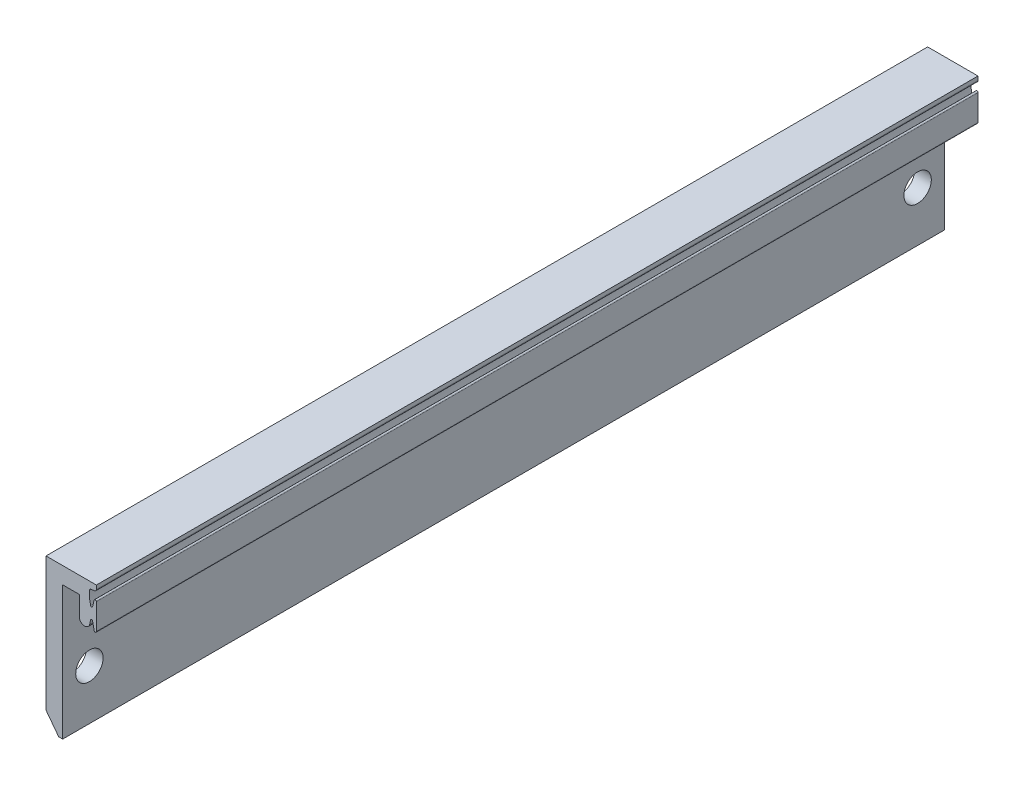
ISO-10303-21;
HEADER;
FILE_DESCRIPTION(('STEP AP214'),'2;1');
FILE_NAME('part.step','',(''),(''),'','','');
FILE_SCHEMA(('AUTOMOTIVE_DESIGN { 1 0 10303 214 1 1 1 1 }'));
ENDSEC;
DATA;
#1=APPLICATION_CONTEXT('core data for automotive mechanical design processes');
#2=APPLICATION_PROTOCOL_DEFINITION('international standard','automotive_design',2000,#1);
#3=PRODUCT_CONTEXT('',#1,'mechanical');
#4=PRODUCT('Part','Part','',(#3));
#5=PRODUCT_RELATED_PRODUCT_CATEGORY('part','',(#4));
#6=PRODUCT_DEFINITION_FORMATION('','',#4);
#7=PRODUCT_DEFINITION_CONTEXT('part definition',#1,'design');
#8=PRODUCT_DEFINITION('design','',#6,#7);
#9=PRODUCT_DEFINITION_SHAPE('','',#8);
#10=(LENGTH_UNIT() NAMED_UNIT(*) SI_UNIT(.MILLI.,.METRE.));
#11=(NAMED_UNIT(*) PLANE_ANGLE_UNIT() SI_UNIT($,.RADIAN.));
#12=(NAMED_UNIT(*) SI_UNIT($,.STERADIAN.) SOLID_ANGLE_UNIT());
#13=UNCERTAINTY_MEASURE_WITH_UNIT(LENGTH_MEASURE(1.E-05),#10,'distance_accuracy_value','');
#14=(GEOMETRIC_REPRESENTATION_CONTEXT(3) GLOBAL_UNCERTAINTY_ASSIGNED_CONTEXT((#13)) GLOBAL_UNIT_ASSIGNED_CONTEXT((#10,
#11,#12)) REPRESENTATION_CONTEXT('',''));
#15=CARTESIAN_POINT('',(0.,0.,0.));
#16=DIRECTION('',(0.,0.,1.));
#17=DIRECTION('',(1.,0.,0.));
#18=AXIS2_PLACEMENT_3D('',#15,#16,#17);
#19=CARTESIAN_POINT('',(2473.35258692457,1.1297441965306E-09,66.));
#20=DIRECTION('',(1.,4.56766335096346E-13,0.));
#21=DIRECTION('',(-4.56766335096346E-13,1.,0.));
#22=AXIS2_PLACEMENT_3D('',#19,#20,#21);
#23=PLANE('',#22);
#24=DIRECTION('',(4.56766335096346E-13,-1.,0.));
#25=VECTOR('',#24,1.);
#26=CARTESIAN_POINT('',(2473.35258692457,1.1297441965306E-09,-66.));
#27=LINE('',#26,#25);
#28=CARTESIAN_POINT('',(2473.35258692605,-3238.37710777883,-66.));
#29=VERTEX_POINT('',#28);
#30=CARTESIAN_POINT('',(2473.35258692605,-3241.29384556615,-66.));
#31=VERTEX_POINT('',#30);
#32=EDGE_CURVE('E213',#29,#31,#27,.T.);
#33=ORIENTED_EDGE('',*,*,#32,.T.);
#34=DIRECTION('',(0.,0.,-1.));
#35=VECTOR('',#34,1.);
#36=CARTESIAN_POINT('',(2473.35258692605,-3241.29384556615,66.));
#37=LINE('',#36,#35);
#38=CARTESIAN_POINT('',(2473.35258692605,-3241.29384556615,66.));
#39=VERTEX_POINT('',#38);
#40=EDGE_CURVE('E11',#39,#31,#37,.T.);
#41=ORIENTED_EDGE('',*,*,#40,.F.);
#42=DIRECTION('',(4.56766335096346E-13,-1.,0.));
#43=VECTOR('',#42,1.);
#44=CARTESIAN_POINT('',(2473.35258692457,1.1297441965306E-09,66.));
#45=LINE('',#44,#43);
#46=CARTESIAN_POINT('',(2473.35258692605,-3238.37710777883,66.));
#47=VERTEX_POINT('',#46);
#48=EDGE_CURVE('E267',#47,#39,#45,.T.);
#49=ORIENTED_EDGE('',*,*,#48,.F.);
#50=DIRECTION('',(0.,0.,-1.));
#51=VECTOR('',#50,1.);
#52=CARTESIAN_POINT('',(2473.35258692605,-3238.37710777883,66.));
#53=LINE('',#52,#51);
#54=EDGE_CURVE('E209',#47,#29,#53,.T.);
#55=ORIENTED_EDGE('',*,*,#54,.T.);
#56=EDGE_LOOP('',(#33,#41,#49,#55));
#57=FACE_BOUND('',#56,.T.);
#58=ADVANCED_FACE('F39',(#57),#23,.F.);
#59=CARTESIAN_POINT('',(2474.13562881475,-3241.29384556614,66.));
#60=DIRECTION('',(0.,0.,-1.));
#61=DIRECTION('',(-1.,0.,0.));
#62=AXIS2_PLACEMENT_3D('',#59,#60,#61);
#63=CYLINDRICAL_SURFACE('',#62,0.783041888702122);
#64=CARTESIAN_POINT('',(2474.13562881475,-3241.29384556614,-66.));
#65=DIRECTION('',(0.,0.,1.));
#66=DIRECTION('',(1.,0.,0.));
#67=AXIS2_PLACEMENT_3D('',#64,#65,#66);
#68=CIRCLE('',#67,0.783041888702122);
#69=CARTESIAN_POINT('',(2474.90170185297,-3241.4559773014,-66.));
#70=VERTEX_POINT('',#69);
#71=EDGE_CURVE('E216',#31,#70,#68,.T.);
#72=ORIENTED_EDGE('',*,*,#71,.T.);
#73=DIRECTION('',(0.,0.,-1.));
#74=VECTOR('',#73,1.);
#75=CARTESIAN_POINT('',(2474.90170185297,-3241.4559773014,66.));
#76=LINE('',#75,#74);
#77=CARTESIAN_POINT('',(2474.90170185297,-3241.4559773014,66.));
#78=VERTEX_POINT('',#77);
#79=EDGE_CURVE('E48',#78,#70,#76,.T.);
#80=ORIENTED_EDGE('',*,*,#79,.F.);
#81=CARTESIAN_POINT('',(2474.13562881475,-3241.29384556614,66.));
#82=DIRECTION('',(0.,0.,1.));
#83=DIRECTION('',(1.,0.,0.));
#84=AXIS2_PLACEMENT_3D('',#81,#82,#83);
#85=CIRCLE('',#84,0.783041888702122);
#86=EDGE_CURVE('E135',#39,#78,#85,.T.);
#87=ORIENTED_EDGE('',*,*,#86,.F.);
#88=ORIENTED_EDGE('',*,*,#40,.T.);
#89=EDGE_LOOP('',(#72,#80,#87,#88));
#90=FACE_BOUND('',#89,.T.);
#91=ADVANCED_FACE('F385',(#90),#63,.T.);
#92=CARTESIAN_POINT('',(3025.41088073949,-640.298106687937,66.));
#93=DIRECTION('',(-0.978329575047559,0.207053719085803,0.));
#94=DIRECTION('',(-0.207053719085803,-0.978329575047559,0.));
#95=AXIS2_PLACEMENT_3D('',#92,#93,#94);
#96=PLANE('',#95);
#97=DIRECTION('',(0.207053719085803,0.978329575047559,0.));
#98=VECTOR('',#97,1.);
#99=CARTESIAN_POINT('',(3025.41088073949,-640.298106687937,-66.));
#100=LINE('',#99,#98);
#101=CARTESIAN_POINT('',(2475.03432887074,-3240.82931416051,-66.));
#102=VERTEX_POINT('',#101);
#103=EDGE_CURVE('E219',#70,#102,#100,.T.);
#104=ORIENTED_EDGE('',*,*,#103,.T.);
#105=DIRECTION('',(0.,0.,-1.));
#106=VECTOR('',#105,1.);
#107=CARTESIAN_POINT('',(2475.03432887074,-3240.82931416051,66.));
#108=LINE('',#107,#106);
#109=CARTESIAN_POINT('',(2475.03432887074,-3240.82931416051,66.));
#110=VERTEX_POINT('',#109);
#111=EDGE_CURVE('E303',#110,#102,#108,.T.);
#112=ORIENTED_EDGE('',*,*,#111,.F.);
#113=DIRECTION('',(0.207053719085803,0.978329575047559,0.));
#114=VECTOR('',#113,1.);
#115=CARTESIAN_POINT('',(3025.41088073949,-640.298106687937,66.));
#116=LINE('',#115,#114);
#117=EDGE_CURVE('E320',#78,#110,#116,.T.);
#118=ORIENTED_EDGE('',*,*,#117,.F.);
#119=ORIENTED_EDGE('',*,*,#79,.T.);
#120=EDGE_LOOP('',(#104,#112,#118,#119));
#121=FACE_BOUND('',#120,.T.);
#122=ADVANCED_FACE('F389',(#121),#96,.F.);
#123=CARTESIAN_POINT('',(2475.18258692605,-3240.85210777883,66.));
#124=DIRECTION('',(0.,0.,-1.));
#125=DIRECTION('',(-1.,0.,0.));
#126=AXIS2_PLACEMENT_3D('',#123,#124,#125);
#127=CYLINDRICAL_SURFACE('',#126,0.149999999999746);
#128=CARTESIAN_POINT('',(2475.18258692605,-3240.85210777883,-66.));
#129=DIRECTION('',(0.,0.,1.));
#130=DIRECTION('',(1.,0.,0.));
#131=AXIS2_PLACEMENT_3D('',#128,#129,#130);
#132=CIRCLE('',#131,0.149999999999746);
#133=CARTESIAN_POINT('',(2475.32961411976,-3240.82239239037,-66.));
#134=VERTEX_POINT('',#133);
#135=EDGE_CURVE('E222',#134,#102,#132,.T.);
#136=ORIENTED_EDGE('',*,*,#135,.F.);
#137=DIRECTION('',(0.,0.,-1.));
#138=VECTOR('',#137,1.);
#139=CARTESIAN_POINT('',(2475.32961411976,-3240.82239239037,66.));
#140=LINE('',#139,#138);
#141=CARTESIAN_POINT('',(2475.32961411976,-3240.82239239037,66.));
#142=VERTEX_POINT('',#141);
#143=EDGE_CURVE('E301',#142,#134,#140,.T.);
#144=ORIENTED_EDGE('',*,*,#143,.F.);
#145=CARTESIAN_POINT('',(2475.18258692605,-3240.85210777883,66.));
#146=DIRECTION('',(0.,0.,1.));
#147=DIRECTION('',(1.,0.,0.));
#148=AXIS2_PLACEMENT_3D('',#145,#146,#147);
#149=CIRCLE('',#148,0.149999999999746);
#150=EDGE_CURVE('E322',#142,#110,#149,.T.);
#151=ORIENTED_EDGE('',*,*,#150,.T.);
#152=ORIENTED_EDGE('',*,*,#111,.T.);
#153=EDGE_LOOP('',(#136,#144,#151,#152));
#154=FACE_BOUND('',#153,.T.);
#155=ADVANCED_FACE('F393',(#154),#127,.F.);
#156=CARTESIAN_POINT('',(1748.89480993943,353.465827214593,66.));
#157=DIRECTION('',(0.980181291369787,0.19810258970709,0.));
#158=DIRECTION('',(-0.19810258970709,0.980181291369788,0.));
#159=AXIS2_PLACEMENT_3D('',#156,#157,#158);
#160=PLANE('',#159);
#161=DIRECTION('',(0.19810258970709,-0.980181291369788,0.));
#162=VECTOR('',#161,1.);
#163=CARTESIAN_POINT('',(1748.89480993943,353.465827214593,-66.));
#164=LINE('',#163,#162);
#165=CARTESIAN_POINT('',(2475.55582897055,-3241.94166884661,-66.));
#166=VERTEX_POINT('',#165);
#167=EDGE_CURVE('E225',#134,#166,#164,.T.);
#168=ORIENTED_EDGE('',*,*,#167,.T.);
#169=DIRECTION('',(0.,0.,-1.));
#170=VECTOR('',#169,1.);
#171=CARTESIAN_POINT('',(2475.55582897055,-3241.94166884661,66.));
#172=LINE('',#171,#170);
#173=CARTESIAN_POINT('',(2475.55582897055,-3241.94166884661,66.));
#174=VERTEX_POINT('',#173);
#175=EDGE_CURVE('E298',#174,#166,#172,.T.);
#176=ORIENTED_EDGE('',*,*,#175,.F.);
#177=DIRECTION('',(0.19810258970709,-0.980181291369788,0.));
#178=VECTOR('',#177,1.);
#179=CARTESIAN_POINT('',(1748.89480993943,353.465827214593,66.));
#180=LINE('',#179,#178);
#181=EDGE_CURVE('E325',#142,#174,#180,.T.);
#182=ORIENTED_EDGE('',*,*,#181,.F.);
#183=ORIENTED_EDGE('',*,*,#143,.T.);
#184=EDGE_LOOP('',(#168,#176,#182,#183));
#185=FACE_BOUND('',#184,.T.);
#186=ADVANCED_FACE('F399',(#185),#160,.F.);
#187=CARTESIAN_POINT('',(2475.72258692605,-3241.90796571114,66.));
#188=DIRECTION('',(0.,0.,-1.));
#189=DIRECTION('',(-1.,0.,0.));
#190=AXIS2_PLACEMENT_3D('',#187,#188,#189);
#191=CYLINDRICAL_SURFACE('',#190,0.17012970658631);
#192=CARTESIAN_POINT('',(2475.72258692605,-3241.90796571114,-66.));
#193=DIRECTION('',(0.,0.,1.));
#194=DIRECTION('',(1.,0.,0.));
#195=AXIS2_PLACEMENT_3D('',#192,#193,#194);
#196=CIRCLE('',#195,0.17012970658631);
#197=CARTESIAN_POINT('',(2475.89258692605,-3241.90132364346,-66.));
#198=VERTEX_POINT('',#197);
#199=EDGE_CURVE('E227',#166,#198,#196,.T.);
#200=ORIENTED_EDGE('',*,*,#199,.T.);
#201=DIRECTION('',(0.,0.,-1.));
#202=VECTOR('',#201,1.);
#203=CARTESIAN_POINT('',(2475.89258692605,-3241.90132364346,66.));
#204=LINE('',#203,#202);
#205=CARTESIAN_POINT('',(2475.89258692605,-3241.90132364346,66.));
#206=VERTEX_POINT('',#205);
#207=EDGE_CURVE('E296',#206,#198,#204,.T.);
#208=ORIENTED_EDGE('',*,*,#207,.F.);
#209=CARTESIAN_POINT('',(2475.72258692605,-3241.90796571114,66.));
#210=DIRECTION('',(0.,0.,1.));
#211=DIRECTION('',(1.,0.,0.));
#212=AXIS2_PLACEMENT_3D('',#209,#210,#211);
#213=CIRCLE('',#212,0.17012970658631);
#214=EDGE_CURVE('E327',#174,#206,#213,.T.);
#215=ORIENTED_EDGE('',*,*,#214,.F.);
#216=ORIENTED_EDGE('',*,*,#175,.T.);
#217=EDGE_LOOP('',(#200,#208,#215,#216));
#218=FACE_BOUND('',#217,.T.);
#219=ADVANCED_FACE('F403',(#218),#191,.T.);
#220=CARTESIAN_POINT('',(2475.89258692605,0.,66.));
#221=DIRECTION('',(1.,0.,0.));
#222=DIRECTION('',(0.,0.,-1.));
#223=AXIS2_PLACEMENT_3D('',#220,#221,#222);
#224=PLANE('',#223);
#225=DIRECTION('',(0.,-1.,0.));
#226=VECTOR('',#225,1.);
#227=CARTESIAN_POINT('',(2475.89258692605,0.,-66.));
#228=LINE('',#227,#226);
#229=CARTESIAN_POINT('',(2475.89258692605,-3238.03960777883,-66.));
#230=VERTEX_POINT('',#229);
#231=EDGE_CURVE('E230',#230,#198,#228,.T.);
#232=ORIENTED_EDGE('',*,*,#231,.F.);
#233=DIRECTION('',(0.,0.,-1.));
#234=VECTOR('',#233,1.);
#235=CARTESIAN_POINT('',(2475.89258692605,-3238.03960777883,66.));
#236=LINE('',#235,#234);
#237=CARTESIAN_POINT('',(2475.89258692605,-3238.03960777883,66.));
#238=VERTEX_POINT('',#237);
#239=EDGE_CURVE('E294',#238,#230,#236,.T.);
#240=ORIENTED_EDGE('',*,*,#239,.F.);
#241=DIRECTION('',(0.,-1.,0.));
#242=VECTOR('',#241,1.);
#243=CARTESIAN_POINT('',(2475.89258692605,0.,66.));
#244=LINE('',#243,#242);
#245=EDGE_CURVE('E329',#238,#206,#244,.T.);
#246=ORIENTED_EDGE('',*,*,#245,.T.);
#247=ORIENTED_EDGE('',*,*,#207,.T.);
#248=EDGE_LOOP('',(#232,#240,#246,#247));
#249=FACE_BOUND('',#248,.T.);
#250=ADVANCED_FACE('F407',(#249),#224,.T.);
#251=CARTESIAN_POINT('',(2475.72258692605,-3238.04624984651,66.));
#252=DIRECTION('',(0.,0.,-1.));
#253=DIRECTION('',(-1.,0.,0.));
#254=AXIS2_PLACEMENT_3D('',#251,#252,#253);
#255=CYLINDRICAL_SURFACE('',#254,0.17012970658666);
#256=CARTESIAN_POINT('',(2475.72258692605,-3238.04624984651,-66.));
#257=DIRECTION('',(0.,0.,1.));
#258=DIRECTION('',(1.,0.,0.));
#259=AXIS2_PLACEMENT_3D('',#256,#257,#258);
#260=CIRCLE('',#259,0.17012970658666);
#261=CARTESIAN_POINT('',(2475.55690402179,-3238.00760670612,-66.));
#262=VERTEX_POINT('',#261);
#263=EDGE_CURVE('E233',#230,#262,#260,.T.);
#264=ORIENTED_EDGE('',*,*,#263,.T.);
#265=DIRECTION('',(0.,0.,-1.));
#266=VECTOR('',#265,1.);
#267=CARTESIAN_POINT('',(2475.55690402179,-3238.00760670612,66.));
#268=LINE('',#267,#266);
#269=CARTESIAN_POINT('',(2475.55690402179,-3238.00760670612,66.));
#270=VERTEX_POINT('',#269);
#271=EDGE_CURVE('E291',#270,#262,#268,.T.);
#272=ORIENTED_EDGE('',*,*,#271,.F.);
#273=CARTESIAN_POINT('',(2475.72258692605,-3238.04624984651,66.));
#274=DIRECTION('',(0.,0.,1.));
#275=DIRECTION('',(1.,0.,0.));
#276=AXIS2_PLACEMENT_3D('',#273,#274,#275);
#277=CIRCLE('',#276,0.17012970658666);
#278=EDGE_CURVE('E332',#238,#270,#277,.T.);
#279=ORIENTED_EDGE('',*,*,#278,.F.);
#280=ORIENTED_EDGE('',*,*,#239,.T.);
#281=EDGE_LOOP('',(#264,#272,#279,#280));
#282=FACE_BOUND('',#281,.T.);
#283=ADVANCED_FACE('F411',(#282),#255,.T.);
#284=CARTESIAN_POINT('',(3064.09234392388,-714.655209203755,66.));
#285=DIRECTION('',(0.973862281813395,-0.227139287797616,0.));
#286=DIRECTION('',(0.227139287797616,0.973862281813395,0.));
#287=AXIS2_PLACEMENT_3D('',#284,#285,#286);
#288=PLANE('',#287);
#289=DIRECTION('',(-0.227139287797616,-0.973862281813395,0.));
#290=VECTOR('',#289,1.);
#291=CARTESIAN_POINT('',(3064.09234392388,-714.655209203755,-66.));
#292=LINE('',#291,#290);
#293=CARTESIAN_POINT('',(2475.32866626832,-3238.986178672,-66.));
#294=VERTEX_POINT('',#293);
#295=EDGE_CURVE('E235',#262,#294,#292,.T.);
#296=ORIENTED_EDGE('',*,*,#295,.T.);
#297=DIRECTION('',(0.,0.,-1.));
#298=VECTOR('',#297,1.);
#299=CARTESIAN_POINT('',(2475.32866626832,-3238.986178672,66.));
#300=LINE('',#299,#298);
#301=CARTESIAN_POINT('',(2475.32866626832,-3238.986178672,66.));
#302=VERTEX_POINT('',#301);
#303=EDGE_CURVE('E289',#302,#294,#300,.T.);
#304=ORIENTED_EDGE('',*,*,#303,.F.);
#305=DIRECTION('',(-0.227139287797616,-0.973862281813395,0.));
#306=VECTOR('',#305,1.);
#307=CARTESIAN_POINT('',(3064.09234392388,-714.655209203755,66.));
#308=LINE('',#307,#306);
#309=EDGE_CURVE('E334',#270,#302,#308,.T.);
#310=ORIENTED_EDGE('',*,*,#309,.F.);
#311=ORIENTED_EDGE('',*,*,#271,.T.);
#312=EDGE_LOOP('',(#296,#304,#310,#311));
#313=FACE_BOUND('',#312,.T.);
#314=ADVANCED_FACE('F415',(#313),#288,.F.);
#315=CARTESIAN_POINT('',(2475.18258692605,-3238.95210777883,66.));
#316=DIRECTION('',(0.,0.,-1.));
#317=DIRECTION('',(-1.,0.,0.));
#318=AXIS2_PLACEMENT_3D('',#315,#316,#317);
#319=CYLINDRICAL_SURFACE('',#318,0.150000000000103);
#320=CARTESIAN_POINT('',(2475.18258692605,-3238.95210777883,-66.));
#321=DIRECTION('',(0.,0.,1.));
#322=DIRECTION('',(1.,0.,0.));
#323=AXIS2_PLACEMENT_3D('',#320,#321,#322);
#324=CIRCLE('',#323,0.150000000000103);
#325=CARTESIAN_POINT('',(2475.03361058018,-3238.96960201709,-66.));
#326=VERTEX_POINT('',#325);
#327=EDGE_CURVE('E238',#326,#294,#324,.T.);
#328=ORIENTED_EDGE('',*,*,#327,.F.);
#329=DIRECTION('',(0.,0.,-1.));
#330=VECTOR('',#329,1.);
#331=CARTESIAN_POINT('',(2475.03361058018,-3238.96960201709,66.));
#332=LINE('',#331,#330);
#333=CARTESIAN_POINT('',(2475.03361058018,-3238.96960201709,66.));
#334=VERTEX_POINT('',#333);
#335=EDGE_CURVE('E287',#334,#326,#332,.T.);
#336=ORIENTED_EDGE('',*,*,#335,.F.);
#337=CARTESIAN_POINT('',(2475.18258692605,-3238.95210777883,66.));
#338=DIRECTION('',(0.,0.,1.));
#339=DIRECTION('',(1.,0.,0.));
#340=AXIS2_PLACEMENT_3D('',#337,#338,#339);
#341=CIRCLE('',#340,0.150000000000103);
#342=EDGE_CURVE('E336',#334,#302,#341,.T.);
#343=ORIENTED_EDGE('',*,*,#342,.T.);
#344=ORIENTED_EDGE('',*,*,#303,.T.);
#345=EDGE_LOOP('',(#328,#336,#343,#344));
#346=FACE_BOUND('',#345,.T.);
#347=ADVANCED_FACE('F419',(#346),#319,.F.);
#348=CARTESIAN_POINT('',(2481.28067168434,-3237.37963252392,66.));
#349=DIRECTION('',(0.,0.,-1.));
#350=DIRECTION('',(-1.,0.,0.));
#351=AXIS2_PLACEMENT_3D('',#348,#349,#350);
#352=CYLINDRICAL_SURFACE('',#351,6.44622179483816);
#353=CARTESIAN_POINT('',(2481.28067168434,-3237.37963252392,-66.));
#354=DIRECTION('',(0.,0.,1.));
#355=DIRECTION('',(1.,0.,0.));
#356=AXIS2_PLACEMENT_3D('',#353,#354,#355);
#357=CIRCLE('',#356,6.44622179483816);
#358=CARTESIAN_POINT('',(2474.83964363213,-3237.12091828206,-66.));
#359=VERTEX_POINT('',#358);
#360=EDGE_CURVE('E241',#359,#326,#357,.T.);
#361=ORIENTED_EDGE('',*,*,#360,.F.);
#362=DIRECTION('',(0.,0.,-1.));
#363=VECTOR('',#362,1.);
#364=CARTESIAN_POINT('',(2474.83964363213,-3237.12091828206,66.));
#365=LINE('',#364,#363);
#366=CARTESIAN_POINT('',(2474.83964363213,-3237.12091828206,66.));
#367=VERTEX_POINT('',#366);
#368=EDGE_CURVE('E285',#367,#359,#365,.T.);
#369=ORIENTED_EDGE('',*,*,#368,.F.);
#370=CARTESIAN_POINT('',(2481.28067168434,-3237.37963252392,66.));
#371=DIRECTION('',(0.,0.,1.));
#372=DIRECTION('',(1.,0.,0.));
#373=AXIS2_PLACEMENT_3D('',#370,#371,#372);
#374=CIRCLE('',#373,6.44622179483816);
#375=EDGE_CURVE('E339',#367,#334,#374,.T.);
#376=ORIENTED_EDGE('',*,*,#375,.T.);
#377=ORIENTED_EDGE('',*,*,#335,.T.);
#378=EDGE_LOOP('',(#361,#369,#376,#377));
#379=FACE_BOUND('',#378,.T.);
#380=ADVANCED_FACE('F423',(#379),#352,.F.);
#381=CARTESIAN_POINT('',(2475.13940192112,-3237.13295855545,66.));
#382=DIRECTION('',(0.,0.,-1.));
#383=DIRECTION('',(-1.,0.,0.));
#384=AXIS2_PLACEMENT_3D('',#381,#382,#383);
#385=CYLINDRICAL_SURFACE('',#384,0.299999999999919);
#386=CARTESIAN_POINT('',(2475.13940192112,-3237.13295855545,-66.));
#387=DIRECTION('',(0.,0.,1.));
#388=DIRECTION('',(1.,0.,0.));
#389=AXIS2_PLACEMENT_3D('',#386,#387,#388);
#390=CIRCLE('',#389,0.299999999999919);
#391=CARTESIAN_POINT('',(2475.09145484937,-3236.83681487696,-66.));
#392=VERTEX_POINT('',#391);
#393=EDGE_CURVE('E244',#392,#359,#390,.T.);
#394=ORIENTED_EDGE('',*,*,#393,.F.);
#395=DIRECTION('',(0.,0.,-1.));
#396=VECTOR('',#395,1.);
#397=CARTESIAN_POINT('',(2475.09145484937,-3236.83681487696,66.));
#398=LINE('',#397,#396);
#399=CARTESIAN_POINT('',(2475.09145484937,-3236.83681487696,66.));
#400=VERTEX_POINT('',#399);
#401=EDGE_CURVE('E283',#400,#392,#398,.T.);
#402=ORIENTED_EDGE('',*,*,#401,.F.);
#403=CARTESIAN_POINT('',(2475.13940192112,-3237.13295855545,66.));
#404=DIRECTION('',(0.,0.,1.));
#405=DIRECTION('',(1.,0.,0.));
#406=AXIS2_PLACEMENT_3D('',#403,#404,#405);
#407=CIRCLE('',#406,0.299999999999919);
#408=EDGE_CURVE('E342',#400,#367,#407,.T.);
#409=ORIENTED_EDGE('',*,*,#408,.T.);
#410=ORIENTED_EDGE('',*,*,#368,.T.);
#411=EDGE_LOOP('',(#394,#402,#409,#410));
#412=FACE_BOUND('',#411,.T.);
#413=ADVANCED_FACE('F427',(#412),#385,.F.);
#414=CARTESIAN_POINT('',(573.895628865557,-3544.64947241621,66.));
#415=DIRECTION('',(-0.159823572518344,0.987145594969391,0.));
#416=DIRECTION('',(-0.987145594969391,-0.159823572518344,0.));
#417=AXIS2_PLACEMENT_3D('',#414,#415,#416);
#418=PLANE('',#417);
#419=DIRECTION('',(0.987145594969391,0.159823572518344,0.));
#420=VECTOR('',#419,1.);
#421=CARTESIAN_POINT('',(573.895628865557,-3544.64947241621,-66.));
#422=LINE('',#421,#420);
#423=CARTESIAN_POINT('',(2475.64053399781,-3236.74791634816,-66.));
#424=VERTEX_POINT('',#423);
#425=EDGE_CURVE('E247',#392,#424,#422,.T.);
#426=ORIENTED_EDGE('',*,*,#425,.T.);
#427=DIRECTION('',(0.,0.,-1.));
#428=VECTOR('',#427,1.);
#429=CARTESIAN_POINT('',(2475.64053399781,-3236.74791634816,66.));
#430=LINE('',#429,#428);
#431=CARTESIAN_POINT('',(2475.64053399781,-3236.74791634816,66.));
#432=VERTEX_POINT('',#431);
#433=EDGE_CURVE('E280',#432,#424,#430,.T.);
#434=ORIENTED_EDGE('',*,*,#433,.F.);
#435=DIRECTION('',(0.987145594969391,0.159823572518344,0.));
#436=VECTOR('',#435,1.);
#437=CARTESIAN_POINT('',(573.895628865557,-3544.64947241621,66.));
#438=LINE('',#437,#436);
#439=EDGE_CURVE('E345',#400,#432,#438,.T.);
#440=ORIENTED_EDGE('',*,*,#439,.F.);
#441=ORIENTED_EDGE('',*,*,#401,.T.);
#442=EDGE_LOOP('',(#426,#434,#440,#441));
#443=FACE_BOUND('',#442,.T.);
#444=ADVANCED_FACE('F431',(#443),#418,.F.);
#445=CARTESIAN_POINT('',(2475.59258692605,-3236.45177266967,66.));
#446=DIRECTION('',(0.,0.,-1.));
#447=DIRECTION('',(-1.,0.,0.));
#448=AXIS2_PLACEMENT_3D('',#445,#446,#447);
#449=CYLINDRICAL_SURFACE('',#448,0.299999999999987);
#450=CARTESIAN_POINT('',(2475.59258692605,-3236.45177266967,-66.));
#451=DIRECTION('',(0.,0.,1.));
#452=DIRECTION('',(1.,0.,0.));
#453=AXIS2_PLACEMENT_3D('',#450,#451,#452);
#454=CIRCLE('',#453,0.299999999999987);
#455=CARTESIAN_POINT('',(2475.89258692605,-3236.45177266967,-66.));
#456=VERTEX_POINT('',#455);
#457=EDGE_CURVE('E249',#424,#456,#454,.T.);
#458=ORIENTED_EDGE('',*,*,#457,.T.);
#459=DIRECTION('',(0.,0.,-1.));
#460=VECTOR('',#459,1.);
#461=CARTESIAN_POINT('',(2475.89258692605,-3236.45177266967,66.));
#462=LINE('',#461,#460);
#463=CARTESIAN_POINT('',(2475.89258692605,-3236.45177266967,66.));
#464=VERTEX_POINT('',#463);
#465=EDGE_CURVE('E278',#464,#456,#462,.T.);
#466=ORIENTED_EDGE('',*,*,#465,.F.);
#467=CARTESIAN_POINT('',(2475.59258692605,-3236.45177266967,66.));
#468=DIRECTION('',(0.,0.,1.));
#469=DIRECTION('',(1.,0.,0.));
#470=AXIS2_PLACEMENT_3D('',#467,#468,#469);
#471=CIRCLE('',#470,0.299999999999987);
#472=EDGE_CURVE('E347',#432,#464,#471,.T.);
#473=ORIENTED_EDGE('',*,*,#472,.F.);
#474=ORIENTED_EDGE('',*,*,#433,.T.);
#475=EDGE_LOOP('',(#458,#466,#473,#474));
#476=FACE_BOUND('',#475,.T.);
#477=ADVANCED_FACE('F435',(#476),#449,.T.);
#478=CARTESIAN_POINT('',(2475.89258693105,-3.82663775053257E-09,66.));
#479=DIRECTION('',(1.,-1.54555887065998E-12,0.));
#480=DIRECTION('',(1.54555887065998E-12,1.,0.));
#481=AXIS2_PLACEMENT_3D('',#478,#479,#480);
#482=PLANE('',#481);
#483=DIRECTION('',(-1.54555887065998E-12,-1.,0.));
#484=VECTOR('',#483,1.);
#485=CARTESIAN_POINT('',(2475.89258693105,-3.82663775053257E-09,-66.));
#486=LINE('',#485,#484);
#487=CARTESIAN_POINT('',(2475.89258692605,-3235.87710777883,-66.));
#488=VERTEX_POINT('',#487);
#489=EDGE_CURVE('E252',#488,#456,#486,.T.);
#490=ORIENTED_EDGE('',*,*,#489,.F.);
#491=DIRECTION('',(0.,0.,-1.));
#492=VECTOR('',#491,1.);
#493=CARTESIAN_POINT('',(2475.89258692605,-3235.87710777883,66.));
#494=LINE('',#493,#492);
#495=CARTESIAN_POINT('',(2475.89258692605,-3235.87710777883,66.));
#496=VERTEX_POINT('',#495);
#497=EDGE_CURVE('E276',#496,#488,#494,.T.);
#498=ORIENTED_EDGE('',*,*,#497,.F.);
#499=DIRECTION('',(-1.54555887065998E-12,-1.,0.));
#500=VECTOR('',#499,1.);
#501=CARTESIAN_POINT('',(2475.89258693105,-3.82663775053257E-09,66.));
#502=LINE('',#501,#500);
#503=EDGE_CURVE('E349',#496,#464,#502,.T.);
#504=ORIENTED_EDGE('',*,*,#503,.T.);
#505=ORIENTED_EDGE('',*,*,#465,.T.);
#506=EDGE_LOOP('',(#490,#498,#504,#505));
#507=FACE_BOUND('',#506,.T.);
#508=ADVANCED_FACE('F439',(#507),#482,.T.);
#509=CARTESIAN_POINT('',(0.,-3235.87710777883,66.));
#510=DIRECTION('',(0.,1.,0.));
#511=DIRECTION('',(0.,0.,1.));
#512=AXIS2_PLACEMENT_3D('',#509,#510,#511);
#513=PLANE('',#512);
#514=DIRECTION('',(1.,0.,0.));
#515=VECTOR('',#514,1.);
#516=CARTESIAN_POINT('',(0.,-3235.87710777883,-66.));
#517=LINE('',#516,#515);
#518=CARTESIAN_POINT('',(2468.35258692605,-3235.87710777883,-66.));
#519=VERTEX_POINT('',#518);
#520=EDGE_CURVE('E255',#519,#488,#517,.T.);
#521=ORIENTED_EDGE('',*,*,#520,.F.);
#522=DIRECTION('',(0.,0.,-1.));
#523=VECTOR('',#522,1.);
#524=CARTESIAN_POINT('',(2468.35258692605,-3235.87710777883,66.));
#525=LINE('',#524,#523);
#526=CARTESIAN_POINT('',(2468.35258692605,-3235.87710777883,66.));
#527=VERTEX_POINT('',#526);
#528=EDGE_CURVE('E274',#527,#519,#525,.T.);
#529=ORIENTED_EDGE('',*,*,#528,.F.);
#530=DIRECTION('',(1.,0.,0.));
#531=VECTOR('',#530,1.);
#532=CARTESIAN_POINT('',(0.,-3235.87710777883,66.));
#533=LINE('',#532,#531);
#534=EDGE_CURVE('E352',#527,#496,#533,.T.);
#535=ORIENTED_EDGE('',*,*,#534,.T.);
#536=ORIENTED_EDGE('',*,*,#497,.T.);
#537=EDGE_LOOP('',(#521,#529,#535,#536));
#538=FACE_BOUND('',#537,.T.);
#539=ADVANCED_FACE('F443',(#538),#513,.T.);
#540=CARTESIAN_POINT('',(2468.35258692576,2.19233749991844E-10,66.));
#541=DIRECTION('',(1.,0.,0.));
#542=DIRECTION('',(0.,1.,0.));
#543=AXIS2_PLACEMENT_3D('',#540,#541,#542);
#544=PLANE('',#543);
#545=CARTESIAN_POINT('',(2468.35258692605,-3250.87710777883,62.));
#546=DIRECTION('',(-1.,0.,0.));
#547=DIRECTION('',(0.,1.,0.));
#548=AXIS2_PLACEMENT_3D('',#545,#546,#547);
#549=CIRCLE('',#548,2.04999999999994);
#550=CARTESIAN_POINT('',(2468.35258692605,-3248.82710777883,62.));
#551=VERTEX_POINT('',#550);
#552=EDGE_CURVE('E315',#551,#551,#549,.T.);
#553=ORIENTED_EDGE('',*,*,#552,.F.);
#554=EDGE_LOOP('',(#553));
#555=FACE_BOUND('',#554,.T.);
#556=CARTESIAN_POINT('',(2468.35258692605,-3250.87710777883,-62.));
#557=DIRECTION('',(-1.,0.,0.));
#558=DIRECTION('',(0.,-1.,0.));
#559=AXIS2_PLACEMENT_3D('',#556,#557,#558);
#560=CIRCLE('',#559,2.04999999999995);
#561=CARTESIAN_POINT('',(2468.35258692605,-3252.92710777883,-62.));
#562=VERTEX_POINT('',#561);
#563=EDGE_CURVE('E307',#562,#562,#560,.T.);
#564=ORIENTED_EDGE('',*,*,#563,.F.);
#565=EDGE_LOOP('',(#564));
#566=FACE_BOUND('',#565,.T.);
#567=DIRECTION('',(0.,-1.,0.));
#568=VECTOR('',#567,1.);
#569=CARTESIAN_POINT('',(2468.35258692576,2.19233749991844E-10,-66.));
#570=LINE('',#569,#568);
#571=CARTESIAN_POINT('',(2468.35258692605,-3255.87710777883,-66.));
#572=VERTEX_POINT('',#571);
#573=EDGE_CURVE('E258',#519,#572,#570,.T.);
#574=ORIENTED_EDGE('',*,*,#573,.T.);
#575=DIRECTION('',(0.,0.,-1.));
#576=VECTOR('',#575,1.);
#577=CARTESIAN_POINT('',(2468.35258692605,-3255.87710777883,66.));
#578=LINE('',#577,#576);
#579=CARTESIAN_POINT('',(2468.35258692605,-3255.87710777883,66.));
#580=VERTEX_POINT('',#579);
#581=EDGE_CURVE('E271',#580,#572,#578,.T.);
#582=ORIENTED_EDGE('',*,*,#581,.F.);
#583=DIRECTION('',(0.,-1.,0.));
#584=VECTOR('',#583,1.);
#585=CARTESIAN_POINT('',(2468.35258692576,2.19233749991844E-10,66.));
#586=LINE('',#585,#584);
#587=EDGE_CURVE('E355',#527,#580,#586,.T.);
#588=ORIENTED_EDGE('',*,*,#587,.F.);
#589=ORIENTED_EDGE('',*,*,#528,.T.);
#590=EDGE_LOOP('',(#574,#582,#588,#589));
#591=FACE_BOUND('',#590,.T.);
#592=ADVANCED_FACE('F361',(#555,#566,#591),#544,.F.);
#593=CARTESIAN_POINT('',(-3.87551659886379,-2.94539261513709,66.));
#594=DIRECTION('',(0.796162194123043,0.605083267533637,0.));
#595=DIRECTION('',(-0.605083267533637,0.796162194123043,0.));
#596=AXIS2_PLACEMENT_3D('',#593,#594,#595);
#597=PLANE('',#596);
#598=DIRECTION('',(0.605083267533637,-0.796162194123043,0.));
#599=VECTOR('',#598,1.);
#600=CARTESIAN_POINT('',(-3.87551659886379,-2.94539261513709,-66.));
#601=LINE('',#600,#599);
#602=CARTESIAN_POINT('',(2470.25258692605,-3258.37710777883,-66.));
#603=VERTEX_POINT('',#602);
#604=EDGE_CURVE('E260',#572,#603,#601,.T.);
#605=ORIENTED_EDGE('',*,*,#604,.T.);
#606=DIRECTION('',(0.,0.,-1.));
#607=VECTOR('',#606,1.);
#608=CARTESIAN_POINT('',(2470.25258692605,-3258.37710777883,66.));
#609=LINE('',#608,#607);
#610=CARTESIAN_POINT('',(2470.25258692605,-3258.37710777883,66.));
#611=VERTEX_POINT('',#610);
#612=EDGE_CURVE('E199',#611,#603,#609,.T.);
#613=ORIENTED_EDGE('',*,*,#612,.F.);
#614=DIRECTION('',(0.605083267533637,-0.796162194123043,0.));
#615=VECTOR('',#614,1.);
#616=CARTESIAN_POINT('',(-3.87551659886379,-2.94539261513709,66.));
#617=LINE('',#616,#615);
#618=EDGE_CURVE('E204',#580,#611,#617,.T.);
#619=ORIENTED_EDGE('',*,*,#618,.F.);
#620=ORIENTED_EDGE('',*,*,#581,.T.);
#621=EDGE_LOOP('',(#605,#613,#619,#620));
#622=FACE_BOUND('',#621,.T.);
#623=ADVANCED_FACE('F365',(#622),#597,.F.);
#624=CARTESIAN_POINT('',(0.,-3258.37710777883,66.));
#625=DIRECTION('',(0.,-1.,0.));
#626=DIRECTION('',(0.,0.,-1.));
#627=AXIS2_PLACEMENT_3D('',#624,#625,#626);
#628=PLANE('',#627);
#629=DIRECTION('',(-1.,0.,0.));
#630=VECTOR('',#629,1.);
#631=CARTESIAN_POINT('',(0.,-3258.37710777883,-66.));
#632=LINE('',#631,#630);
#633=CARTESIAN_POINT('',(2470.85258692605,-3258.37710777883,-66.));
#634=VERTEX_POINT('',#633);
#635=EDGE_CURVE('E194',#634,#603,#632,.T.);
#636=ORIENTED_EDGE('',*,*,#635,.F.);
#637=DIRECTION('',(0.,0.,-1.));
#638=VECTOR('',#637,1.);
#639=CARTESIAN_POINT('',(2470.85258692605,-3258.37710777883,66.));
#640=LINE('',#639,#638);
#641=CARTESIAN_POINT('',(2470.85258692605,-3258.37710777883,66.));
#642=VERTEX_POINT('',#641);
#643=EDGE_CURVE('E189',#642,#634,#640,.T.);
#644=ORIENTED_EDGE('',*,*,#643,.F.);
#645=DIRECTION('',(-1.,0.,0.));
#646=VECTOR('',#645,1.);
#647=CARTESIAN_POINT('',(0.,-3258.37710777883,66.));
#648=LINE('',#647,#646);
#649=EDGE_CURVE('E192',#642,#611,#648,.T.);
#650=ORIENTED_EDGE('',*,*,#649,.T.);
#651=ORIENTED_EDGE('',*,*,#612,.T.);
#652=EDGE_LOOP('',(#636,#644,#650,#651));
#653=FACE_BOUND('',#652,.T.);
#654=ADVANCED_FACE('F191',(#653),#628,.T.);
#655=CARTESIAN_POINT('',(2470.85258692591,1.09727897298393E-10,66.));
#656=DIRECTION('',(1.,0.,0.));
#657=DIRECTION('',(0.,1.,0.));
#658=AXIS2_PLACEMENT_3D('',#655,#656,#657);
#659=PLANE('',#658);
#660=CARTESIAN_POINT('',(2470.85258692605,-3250.87710777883,62.));
#661=DIRECTION('',(1.,0.,0.));
#662=DIRECTION('',(0.,1.,0.));
#663=AXIS2_PLACEMENT_3D('',#660,#661,#662);
#664=CIRCLE('',#663,2.04999999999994);
#665=CARTESIAN_POINT('',(2470.85258692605,-3248.82710777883,62.));
#666=VERTEX_POINT('',#665);
#667=EDGE_CURVE('E42',#666,#666,#664,.T.);
#668=ORIENTED_EDGE('',*,*,#667,.F.);
#669=EDGE_LOOP('',(#668));
#670=FACE_BOUND('',#669,.T.);
#671=CARTESIAN_POINT('',(2470.85258692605,-3250.87710777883,-62.));
#672=DIRECTION('',(1.,0.,0.));
#673=DIRECTION('',(0.,1.,0.));
#674=AXIS2_PLACEMENT_3D('',#671,#672,#673);
#675=CIRCLE('',#674,2.04999999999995);
#676=CARTESIAN_POINT('',(2470.85258692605,-3248.82710777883,-62.));
#677=VERTEX_POINT('',#676);
#678=EDGE_CURVE('E217',#677,#677,#675,.T.);
#679=ORIENTED_EDGE('',*,*,#678,.F.);
#680=EDGE_LOOP('',(#679));
#681=FACE_BOUND('',#680,.T.);
#682=DIRECTION('',(0.,-1.,0.));
#683=VECTOR('',#682,1.);
#684=CARTESIAN_POINT('',(2470.85258692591,1.09727897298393E-10,-66.));
#685=LINE('',#684,#683);
#686=CARTESIAN_POINT('',(2470.85258692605,-3238.37710777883,-66.));
#687=VERTEX_POINT('',#686);
#688=EDGE_CURVE('E264',#687,#634,#685,.T.);
#689=ORIENTED_EDGE('',*,*,#688,.F.);
#690=DIRECTION('',(0.,0.,-1.));
#691=VECTOR('',#690,1.);
#692=CARTESIAN_POINT('',(2470.85258692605,-3238.37710777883,66.));
#693=LINE('',#692,#691);
#694=CARTESIAN_POINT('',(2470.85258692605,-3238.37710777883,66.));
#695=VERTEX_POINT('',#694);
#696=EDGE_CURVE('E124',#695,#687,#693,.T.);
#697=ORIENTED_EDGE('',*,*,#696,.F.);
#698=DIRECTION('',(0.,-1.,0.));
#699=VECTOR('',#698,1.);
#700=CARTESIAN_POINT('',(2470.85258692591,1.09727897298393E-10,66.));
#701=LINE('',#700,#699);
#702=EDGE_CURVE('E202',#695,#642,#701,.T.);
#703=ORIENTED_EDGE('',*,*,#702,.T.);
#704=ORIENTED_EDGE('',*,*,#643,.T.);
#705=EDGE_LOOP('',(#689,#697,#703,#704));
#706=FACE_BOUND('',#705,.T.);
#707=ADVANCED_FACE('F207',(#670,#681,#706),#659,.T.);
#708=CARTESIAN_POINT('',(0.,-3238.37710777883,66.));
#709=DIRECTION('',(0.,1.,0.));
#710=DIRECTION('',(0.,0.,1.));
#711=AXIS2_PLACEMENT_3D('',#708,#709,#710);
#712=PLANE('',#711);
#713=DIRECTION('',(1.,0.,0.));
#714=VECTOR('',#713,1.);
#715=CARTESIAN_POINT('',(0.,-3238.37710777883,-66.));
#716=LINE('',#715,#714);
#717=EDGE_CURVE('E127',#687,#29,#716,.T.);
#718=ORIENTED_EDGE('',*,*,#717,.T.);
#719=ORIENTED_EDGE('',*,*,#54,.F.);
#720=DIRECTION('',(1.,0.,0.));
#721=VECTOR('',#720,1.);
#722=CARTESIAN_POINT('',(0.,-3238.37710777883,66.));
#723=LINE('',#722,#721);
#724=EDGE_CURVE('E57',#695,#47,#723,.T.);
#725=ORIENTED_EDGE('',*,*,#724,.F.);
#726=ORIENTED_EDGE('',*,*,#696,.T.);
#727=EDGE_LOOP('',(#718,#719,#725,#726));
#728=FACE_BOUND('',#727,.T.);
#729=ADVANCED_FACE('F373',(#728),#712,.F.);
#730=CARTESIAN_POINT('',(0.,0.,66.));
#731=DIRECTION('',(0.,0.,1.));
#732=DIRECTION('',(1.,0.,0.));
#733=AXIS2_PLACEMENT_3D('',#730,#731,#732);
#734=PLANE('',#733);
#735=ORIENTED_EDGE('',*,*,#48,.T.);
#736=ORIENTED_EDGE('',*,*,#86,.T.);
#737=ORIENTED_EDGE('',*,*,#117,.T.);
#738=ORIENTED_EDGE('',*,*,#150,.F.);
#739=ORIENTED_EDGE('',*,*,#181,.T.);
#740=ORIENTED_EDGE('',*,*,#214,.T.);
#741=ORIENTED_EDGE('',*,*,#245,.F.);
#742=ORIENTED_EDGE('',*,*,#278,.T.);
#743=ORIENTED_EDGE('',*,*,#309,.T.);
#744=ORIENTED_EDGE('',*,*,#342,.F.);
#745=ORIENTED_EDGE('',*,*,#375,.F.);
#746=ORIENTED_EDGE('',*,*,#408,.F.);
#747=ORIENTED_EDGE('',*,*,#439,.T.);
#748=ORIENTED_EDGE('',*,*,#472,.T.);
#749=ORIENTED_EDGE('',*,*,#503,.F.);
#750=ORIENTED_EDGE('',*,*,#534,.F.);
#751=ORIENTED_EDGE('',*,*,#587,.T.);
#752=ORIENTED_EDGE('',*,*,#618,.T.);
#753=ORIENTED_EDGE('',*,*,#649,.F.);
#754=ORIENTED_EDGE('',*,*,#702,.F.);
#755=ORIENTED_EDGE('',*,*,#724,.T.);
#756=EDGE_LOOP('',(#735,#736,#737,#738,#739,#740,#741,#742,#743,#744,#745,#746,#747,#748,#749,
#750,#751,#752,#753,#754,#755));
#757=FACE_BOUND('',#756,.T.);
#758=ADVANCED_FACE('F201',(#757),#734,.T.);
#759=CARTESIAN_POINT('',(0.,0.,-66.));
#760=DIRECTION('',(0.,0.,1.));
#761=DIRECTION('',(1.,0.,0.));
#762=AXIS2_PLACEMENT_3D('',#759,#760,#761);
#763=PLANE('',#762);
#764=ORIENTED_EDGE('',*,*,#32,.F.);
#765=ORIENTED_EDGE('',*,*,#717,.F.);
#766=ORIENTED_EDGE('',*,*,#688,.T.);
#767=ORIENTED_EDGE('',*,*,#635,.T.);
#768=ORIENTED_EDGE('',*,*,#604,.F.);
#769=ORIENTED_EDGE('',*,*,#573,.F.);
#770=ORIENTED_EDGE('',*,*,#520,.T.);
#771=ORIENTED_EDGE('',*,*,#489,.T.);
#772=ORIENTED_EDGE('',*,*,#457,.F.);
#773=ORIENTED_EDGE('',*,*,#425,.F.);
#774=ORIENTED_EDGE('',*,*,#393,.T.);
#775=ORIENTED_EDGE('',*,*,#360,.T.);
#776=ORIENTED_EDGE('',*,*,#327,.T.);
#777=ORIENTED_EDGE('',*,*,#295,.F.);
#778=ORIENTED_EDGE('',*,*,#263,.F.);
#779=ORIENTED_EDGE('',*,*,#231,.T.);
#780=ORIENTED_EDGE('',*,*,#199,.F.);
#781=ORIENTED_EDGE('',*,*,#167,.F.);
#782=ORIENTED_EDGE('',*,*,#135,.T.);
#783=ORIENTED_EDGE('',*,*,#103,.F.);
#784=ORIENTED_EDGE('',*,*,#71,.F.);
#785=EDGE_LOOP('',(#764,#765,#766,#767,#768,#769,#770,#771,#772,#773,#774,#775,#776,#777,#778,
#779,#780,#781,#782,#783,#784));
#786=FACE_BOUND('',#785,.T.);
#787=ADVANCED_FACE('F368',(#786),#763,.F.);
#788=CARTESIAN_POINT('',(2475.89271663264,-3250.87710777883,-62.));
#789=DIRECTION('',(-1.,0.,0.));
#790=DIRECTION('',(0.,-1.,0.));
#791=AXIS2_PLACEMENT_3D('',#788,#789,#790);
#792=CYLINDRICAL_SURFACE('',#791,2.04999999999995);
#793=ORIENTED_EDGE('',*,*,#678,.T.);
#794=EDGE_LOOP('',(#793));
#795=FACE_BOUND('',#794,.T.);
#796=ORIENTED_EDGE('',*,*,#563,.T.);
#797=EDGE_LOOP('',(#796));
#798=FACE_BOUND('',#797,.T.);
#799=ADVANCED_FACE('F472',(#795,#798),#792,.F.);
#800=CARTESIAN_POINT('',(2475.89271663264,-3250.87710777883,62.));
#801=DIRECTION('',(-1.,0.,0.));
#802=DIRECTION('',(0.,-1.,0.));
#803=AXIS2_PLACEMENT_3D('',#800,#801,#802);
#804=CYLINDRICAL_SURFACE('',#803,2.04999999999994);
#805=ORIENTED_EDGE('',*,*,#667,.T.);
#806=EDGE_LOOP('',(#805));
#807=FACE_BOUND('',#806,.T.);
#808=ORIENTED_EDGE('',*,*,#552,.T.);
#809=EDGE_LOOP('',(#808));
#810=FACE_BOUND('',#809,.T.);
#811=ADVANCED_FACE('F477',(#807,#810),#804,.F.);
#812=CLOSED_SHELL('',(#58,#91,#122,#155,#186,#219,#250,#283,#314,#347,#380,#413,#444,#477,#508,
#539,#592,#623,#654,#707,#729,#758,#787,#799,#811));
#813=MANIFOLD_SOLID_BREP('B2',#812);
#814=ADVANCED_BREP_SHAPE_REPRESENTATION('',(#18,#813),#14);
#815=SHAPE_DEFINITION_REPRESENTATION(#9,#814);
ENDSEC;
END-ISO-10303-21;
